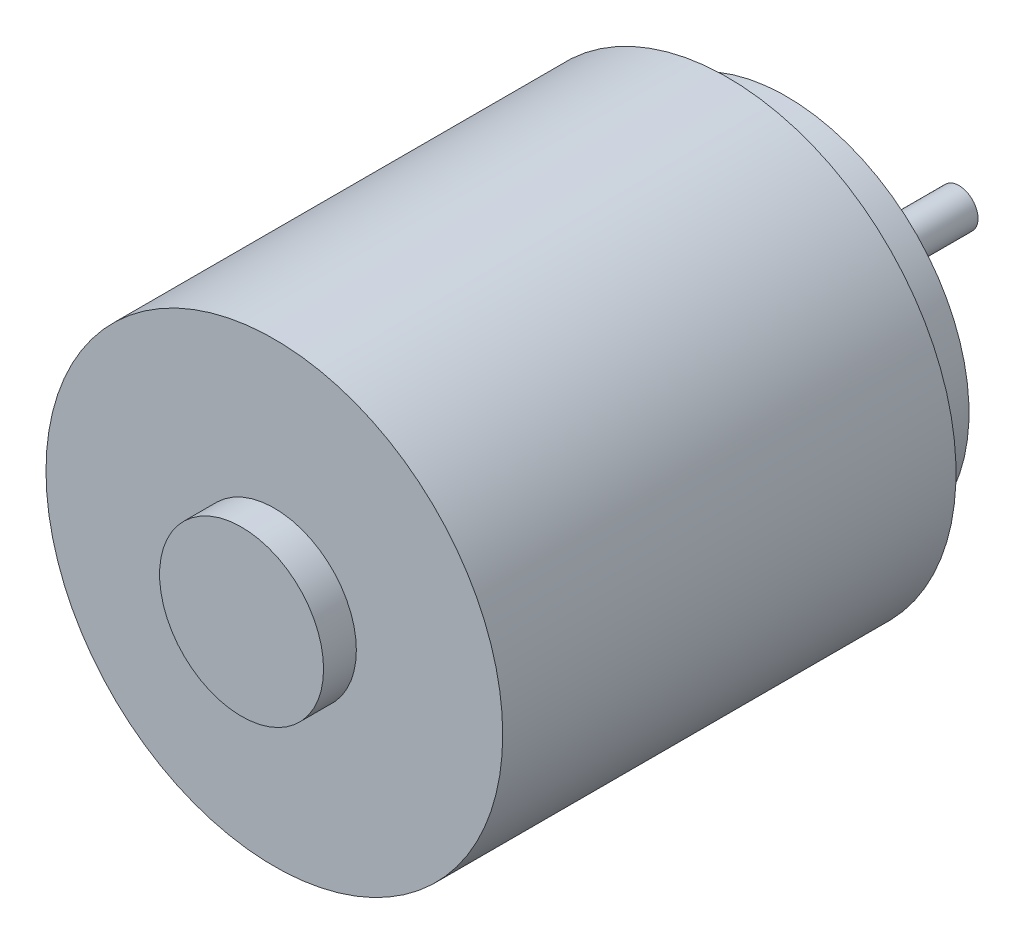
from build123d import *

# Parameters (mm, degrees)
SKETCH2_R         = 11.8364
MAIN_BODY_DEPTH   = 26.543
SKETCH3_R         = 4.25
BACK_NUB_DEPTH    = 1.7
SKETCH4_OUTSIDE_W = 34.432
SKETCH4_OUTSIDE_H = 34.432
SKETCH4_OUTSIDE_R = 9.4615
FRONT_NUB_DEPTH   = 3.048
SKETCH5_R         = 3.0099
SHAFT_NUB_DEPTH   = 1.7
SKETCH6_R         = 0.9906
SHAFT_DEPTH       = 7.239


with BuildPart() as part:
    # Sketch2 → Main Body (new body)
    with BuildSketch(Plane.XY):
        with Locations(Location((0, 0, 0), (0, 0, 180))):
            Circle(SKETCH2_R)
    extrude(amount=MAIN_BODY_DEPTH)

    # Sketch3 → Back Nub (add)
    with BuildSketch(Plane.XY.offset(26.543)):
        Circle(SKETCH3_R)
    extrude(amount=BACK_NUB_DEPTH)

    # Sketch4 outside → Front Nub (cut)
    with BuildSketch(Plane(origin=(0, 0, 0), x_dir=(-1, 0, 0), z_dir=(0, 0, -1))):
        Rectangle(SKETCH4_OUTSIDE_W, SKETCH4_OUTSIDE_H)
        Circle(SKETCH4_OUTSIDE_R, mode=Mode.SUBTRACT)
    extrude(amount=-FRONT_NUB_DEPTH, mode=Mode.SUBTRACT)

    # Sketch5 → Shaft Nub (add)
    with BuildSketch(Plane(origin=(0, 0, 0), x_dir=(-1, 0, 0), z_dir=(0, 0, -1))):
        with Locations(Location((0, 0, 0), (0, 0, 180))):
            Circle(SKETCH5_R)
    extrude(amount=SHAFT_NUB_DEPTH)

    # Sketch6 → Shaft (add)
    with BuildSketch(Plane(origin=(0, 0, -1.7), x_dir=(-1, 0, 0), z_dir=(0, 0, -1))):
        Circle(SKETCH6_R)
    extrude(amount=SHAFT_DEPTH)


solid = part.part
